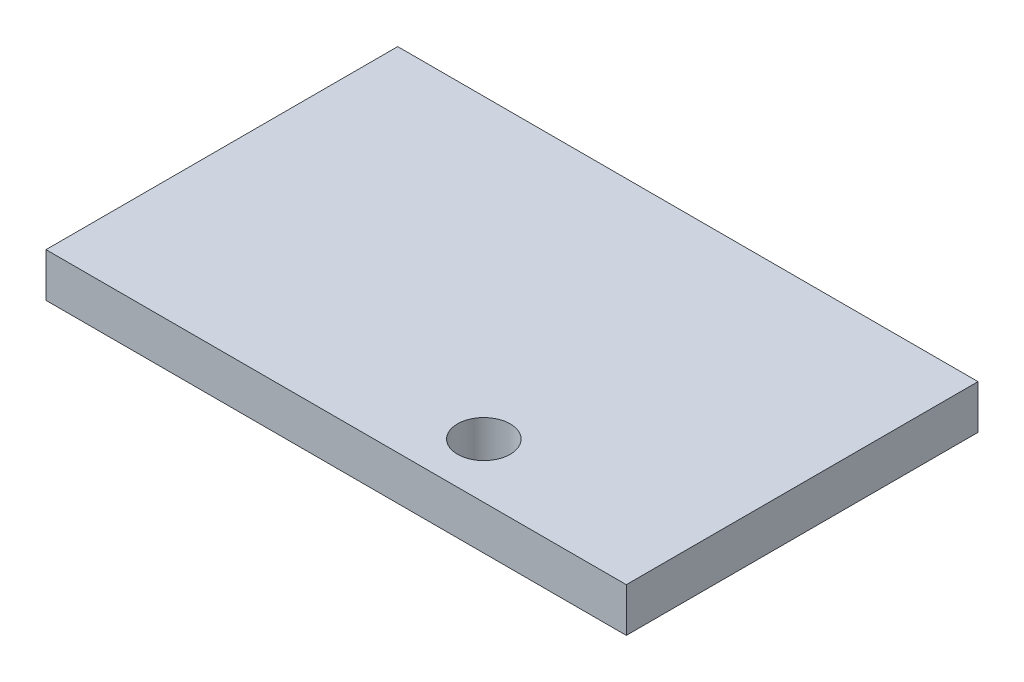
from build123d import *

# Parameters (mm, degrees)
SKETCH1_W           = 33
SKETCH1_H           = 20
BOSS_EXTRUDE1_DEPTH = 2.5
SKETCH2_R           = 1.5
CUT_EXTRUDE1_DEPTH  = 2.5


with BuildPart() as part:
    # Sketch1 → Boss-Extrude1 (new body)
    with BuildSketch(Plane(origin=(0, 0, 0), x_dir=(1, 0, 0), z_dir=(0, 1, 0))):
        with Locations((-0.507092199, -0.716312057)):
            Rectangle(SKETCH1_W, SKETCH1_H)
    extrude(amount=BOSS_EXTRUDE1_DEPTH)

    # Sketch2 → Cut-Extrude1 (cut)
    with BuildSketch(Plane(origin=(0, 2.5, 0), x_dir=(1, 0, 0), z_dir=(0, 1, 0))):
        with Locations(Location((4.772776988, -7.596742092, 0), (0, 0, 270))):
            Circle(SKETCH2_R)
    extrude(amount=-CUT_EXTRUDE1_DEPTH, mode=Mode.SUBTRACT)


solid = part.part
